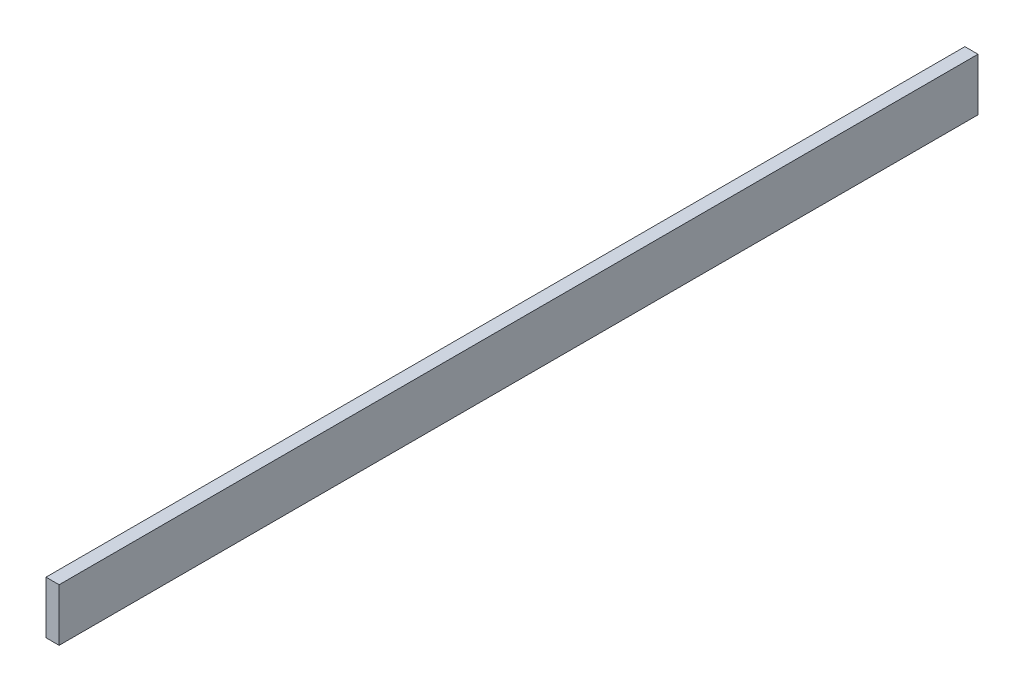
from build123d import *

# Parameters (mm, degrees)
ESQUISSE1_W      = 5
ESQUISSE1_H      = 20
EXTRUSION1_DEPTH = 350


with BuildPart() as part:
    # Esquisse1 → Extrusion1 (new body)
    with BuildSketch(Plane.XY):
        with Locations((0, 10)):
            Rectangle(ESQUISSE1_W, ESQUISSE1_H)
    extrude(amount=EXTRUSION1_DEPTH)


solid = part.part
